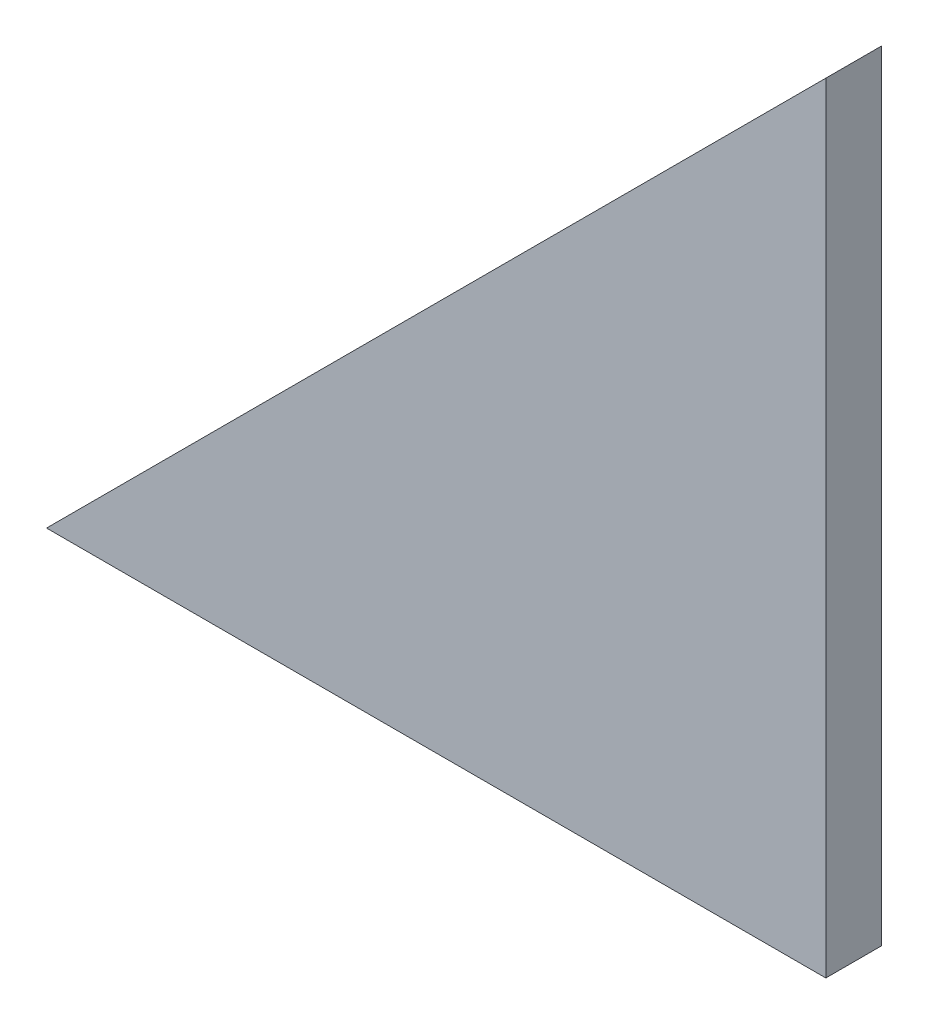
ISO-10303-21;
HEADER;
FILE_DESCRIPTION(('STEP AP214'),'2;1');
FILE_NAME('part.step','',(''),(''),'','','');
FILE_SCHEMA(('AUTOMOTIVE_DESIGN { 1 0 10303 214 1 1 1 1 }'));
ENDSEC;
DATA;
#1=APPLICATION_CONTEXT('core data for automotive mechanical design processes');
#2=APPLICATION_PROTOCOL_DEFINITION('international standard','automotive_design',2000,#1);
#3=PRODUCT_CONTEXT('',#1,'mechanical');
#4=PRODUCT('Part','Part','',(#3));
#5=PRODUCT_RELATED_PRODUCT_CATEGORY('part','',(#4));
#6=PRODUCT_DEFINITION_FORMATION('','',#4);
#7=PRODUCT_DEFINITION_CONTEXT('part definition',#1,'design');
#8=PRODUCT_DEFINITION('design','',#6,#7);
#9=PRODUCT_DEFINITION_SHAPE('','',#8);
#10=(LENGTH_UNIT() NAMED_UNIT(*) SI_UNIT(.MILLI.,.METRE.));
#11=(NAMED_UNIT(*) PLANE_ANGLE_UNIT() SI_UNIT($,.RADIAN.));
#12=(NAMED_UNIT(*) SI_UNIT($,.STERADIAN.) SOLID_ANGLE_UNIT());
#13=UNCERTAINTY_MEASURE_WITH_UNIT(LENGTH_MEASURE(1.E-05),#10,'distance_accuracy_value','');
#14=(GEOMETRIC_REPRESENTATION_CONTEXT(3) GLOBAL_UNCERTAINTY_ASSIGNED_CONTEXT((#13)) GLOBAL_UNIT_ASSIGNED_CONTEXT((#10,
#11,#12)) REPRESENTATION_CONTEXT('',''));
#15=CARTESIAN_POINT('',(0.,0.,0.));
#16=DIRECTION('',(0.,0.,1.));
#17=DIRECTION('',(1.,0.,0.));
#18=AXIS2_PLACEMENT_3D('',#15,#16,#17);
#19=CARTESIAN_POINT('',(88.9,88.9,6.35000000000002));
#20=DIRECTION('',(0.707106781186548,-0.707106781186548,0.));
#21=DIRECTION('',(0.707106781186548,0.707106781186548,0.));
#22=AXIS2_PLACEMENT_3D('',#19,#20,#21);
#23=PLANE('',#22);
#24=DIRECTION('',(-0.707106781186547,-0.707106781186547,0.));
#25=VECTOR('',#24,1.);
#26=CARTESIAN_POINT('',(88.9,88.9,0.));
#27=LINE('',#26,#25);
#28=CARTESIAN_POINT('',(88.9,88.9,0.));
#29=VERTEX_POINT('',#28);
#30=CARTESIAN_POINT('',(0.,0.,0.));
#31=VERTEX_POINT('',#30);
#32=EDGE_CURVE('E87',#29,#31,#27,.T.);
#33=ORIENTED_EDGE('',*,*,#32,.T.);
#34=DIRECTION('',(0.,0.,-1.));
#35=VECTOR('',#34,1.);
#36=CARTESIAN_POINT('',(0.,0.,6.35000000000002));
#37=LINE('',#36,#35);
#38=CARTESIAN_POINT('',(0.,0.,6.35000000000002));
#39=VERTEX_POINT('',#38);
#40=EDGE_CURVE('E11',#39,#31,#37,.T.);
#41=ORIENTED_EDGE('',*,*,#40,.F.);
#42=DIRECTION('',(-0.707106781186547,-0.707106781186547,0.));
#43=VECTOR('',#42,1.);
#44=CARTESIAN_POINT('',(88.9,88.9,6.35000000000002));
#45=LINE('',#44,#43);
#46=CARTESIAN_POINT('',(88.9,88.9,6.35000000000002));
#47=VERTEX_POINT('',#46);
#48=EDGE_CURVE('E79',#47,#39,#45,.T.);
#49=ORIENTED_EDGE('',*,*,#48,.F.);
#50=DIRECTION('',(0.,0.,-1.));
#51=VECTOR('',#50,1.);
#52=CARTESIAN_POINT('',(88.9,88.9,6.35000000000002));
#53=LINE('',#52,#51);
#54=EDGE_CURVE('E88',#47,#29,#53,.T.);
#55=ORIENTED_EDGE('',*,*,#54,.T.);
#56=EDGE_LOOP('',(#33,#41,#49,#55));
#57=FACE_BOUND('',#56,.T.);
#58=ADVANCED_FACE('F38',(#57),#23,.F.);
#59=CARTESIAN_POINT('',(0.,0.,6.35000000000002));
#60=DIRECTION('',(0.,1.,0.));
#61=DIRECTION('',(0.,0.,1.));
#62=AXIS2_PLACEMENT_3D('',#59,#60,#61);
#63=PLANE('',#62);
#64=DIRECTION('',(1.,0.,0.));
#65=VECTOR('',#64,1.);
#66=CARTESIAN_POINT('',(0.,0.,0.));
#67=LINE('',#66,#65);
#68=CARTESIAN_POINT('',(88.9,0.,0.));
#69=VERTEX_POINT('',#68);
#70=EDGE_CURVE('E66',#31,#69,#67,.T.);
#71=ORIENTED_EDGE('',*,*,#70,.T.);
#72=DIRECTION('',(0.,0.,-1.));
#73=VECTOR('',#72,1.);
#74=CARTESIAN_POINT('',(88.9,0.,6.35000000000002));
#75=LINE('',#74,#73);
#76=CARTESIAN_POINT('',(88.9,0.,6.35000000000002));
#77=VERTEX_POINT('',#76);
#78=EDGE_CURVE('E46',#77,#69,#75,.T.);
#79=ORIENTED_EDGE('',*,*,#78,.F.);
#80=DIRECTION('',(1.,0.,0.));
#81=VECTOR('',#80,1.);
#82=CARTESIAN_POINT('',(0.,0.,6.35000000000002));
#83=LINE('',#82,#81);
#84=EDGE_CURVE('E74',#39,#77,#83,.T.);
#85=ORIENTED_EDGE('',*,*,#84,.F.);
#86=ORIENTED_EDGE('',*,*,#40,.T.);
#87=EDGE_LOOP('',(#71,#79,#85,#86));
#88=FACE_BOUND('',#87,.T.);
#89=ADVANCED_FACE('F75',(#88),#63,.F.);
#90=CARTESIAN_POINT('',(88.9,0.,6.35000000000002));
#91=DIRECTION('',(-1.,0.,0.));
#92=DIRECTION('',(0.,0.,1.));
#93=AXIS2_PLACEMENT_3D('',#90,#91,#92);
#94=PLANE('',#93);
#95=DIRECTION('',(0.,1.,0.));
#96=VECTOR('',#95,1.);
#97=CARTESIAN_POINT('',(88.9,0.,0.));
#98=LINE('',#97,#96);
#99=EDGE_CURVE('E71',#69,#29,#98,.T.);
#100=ORIENTED_EDGE('',*,*,#99,.T.);
#101=ORIENTED_EDGE('',*,*,#54,.F.);
#102=DIRECTION('',(0.,1.,0.));
#103=VECTOR('',#102,1.);
#104=CARTESIAN_POINT('',(88.9,0.,6.35000000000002));
#105=LINE('',#104,#103);
#106=EDGE_CURVE('E54',#77,#47,#105,.T.);
#107=ORIENTED_EDGE('',*,*,#106,.F.);
#108=ORIENTED_EDGE('',*,*,#78,.T.);
#109=EDGE_LOOP('',(#100,#101,#107,#108));
#110=FACE_BOUND('',#109,.T.);
#111=ADVANCED_FACE('F98',(#110),#94,.F.);
#112=CARTESIAN_POINT('',(0.,0.,6.35000000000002));
#113=DIRECTION('',(0.,0.,1.));
#114=DIRECTION('',(1.,0.,0.));
#115=AXIS2_PLACEMENT_3D('',#112,#113,#114);
#116=PLANE('',#115);
#117=ORIENTED_EDGE('',*,*,#48,.T.);
#118=ORIENTED_EDGE('',*,*,#84,.T.);
#119=ORIENTED_EDGE('',*,*,#106,.T.);
#120=EDGE_LOOP('',(#117,#118,#119));
#121=FACE_BOUND('',#120,.T.);
#122=ADVANCED_FACE('F82',(#121),#116,.T.);
#123=CARTESIAN_POINT('',(0.,0.,0.));
#124=DIRECTION('',(0.,0.,1.));
#125=DIRECTION('',(1.,0.,0.));
#126=AXIS2_PLACEMENT_3D('',#123,#124,#125);
#127=PLANE('',#126);
#128=ORIENTED_EDGE('',*,*,#32,.F.);
#129=ORIENTED_EDGE('',*,*,#99,.F.);
#130=ORIENTED_EDGE('',*,*,#70,.F.);
#131=EDGE_LOOP('',(#128,#129,#130));
#132=FACE_BOUND('',#131,.T.);
#133=ADVANCED_FACE('F99',(#132),#127,.F.);
#134=CLOSED_SHELL('',(#58,#89,#111,#122,#133));
#135=MANIFOLD_SOLID_BREP('B2',#134);
#136=ADVANCED_BREP_SHAPE_REPRESENTATION('',(#18,#135),#14);
#137=SHAPE_DEFINITION_REPRESENTATION(#9,#136);
ENDSEC;
END-ISO-10303-21;
